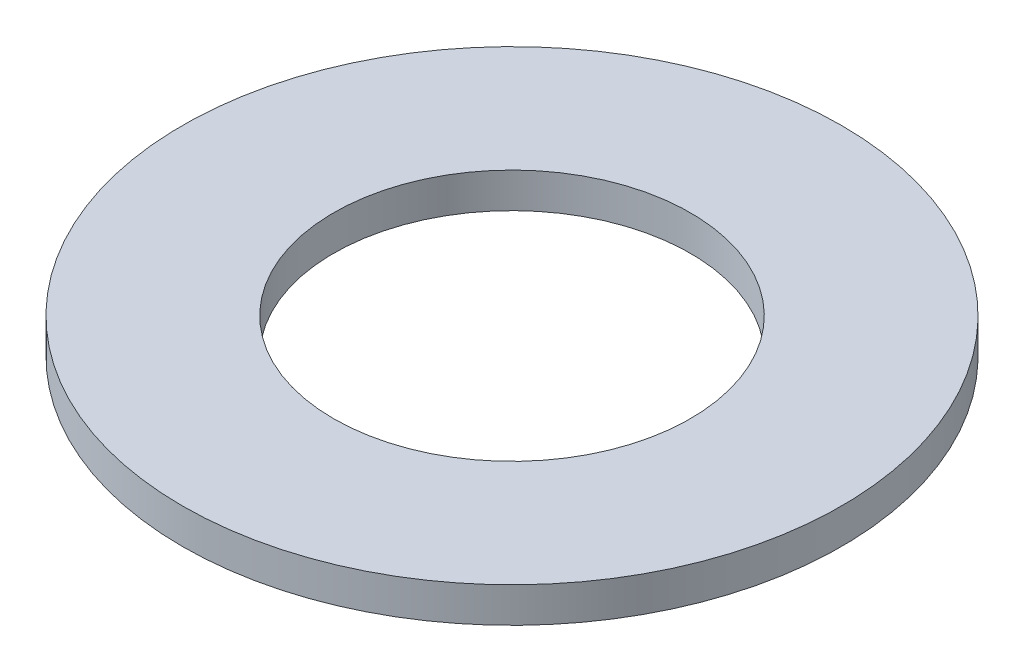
from build123d import *

# Parameters (mm, degrees)
SKETCH1_R           = 9.525
BOSS_EXTRUDE1_DEPTH = 1.016
SKETCH5_R           = 5.1562
CUT_EXTRUDE1_DEPTH  = 14.508645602


with BuildPart() as part:
    # Sketch1 → Boss-Extrude1 (new body)
    with BuildSketch(Plane(origin=(0, 0, 0), x_dir=(1, 0, 0), z_dir=(0, 1, 0))):
        with Locations(Location((0, 0, 0), (0, 0, 270))):
            Circle(SKETCH1_R)
    extrude(amount=BOSS_EXTRUDE1_DEPTH)

    # Sketch5 → Cut-Extrude1 (cut, through all)
    with BuildSketch(Plane(origin=(0, 1.016, 0), x_dir=(-1, 0, 0), z_dir=(0, 1, 0))):
        with Locations(Location((0, 0, 0), (0, 0, 90))):
            Circle(SKETCH5_R)
    extrude(amount=-CUT_EXTRUDE1_DEPTH, mode=Mode.SUBTRACT)


solid = part.part
